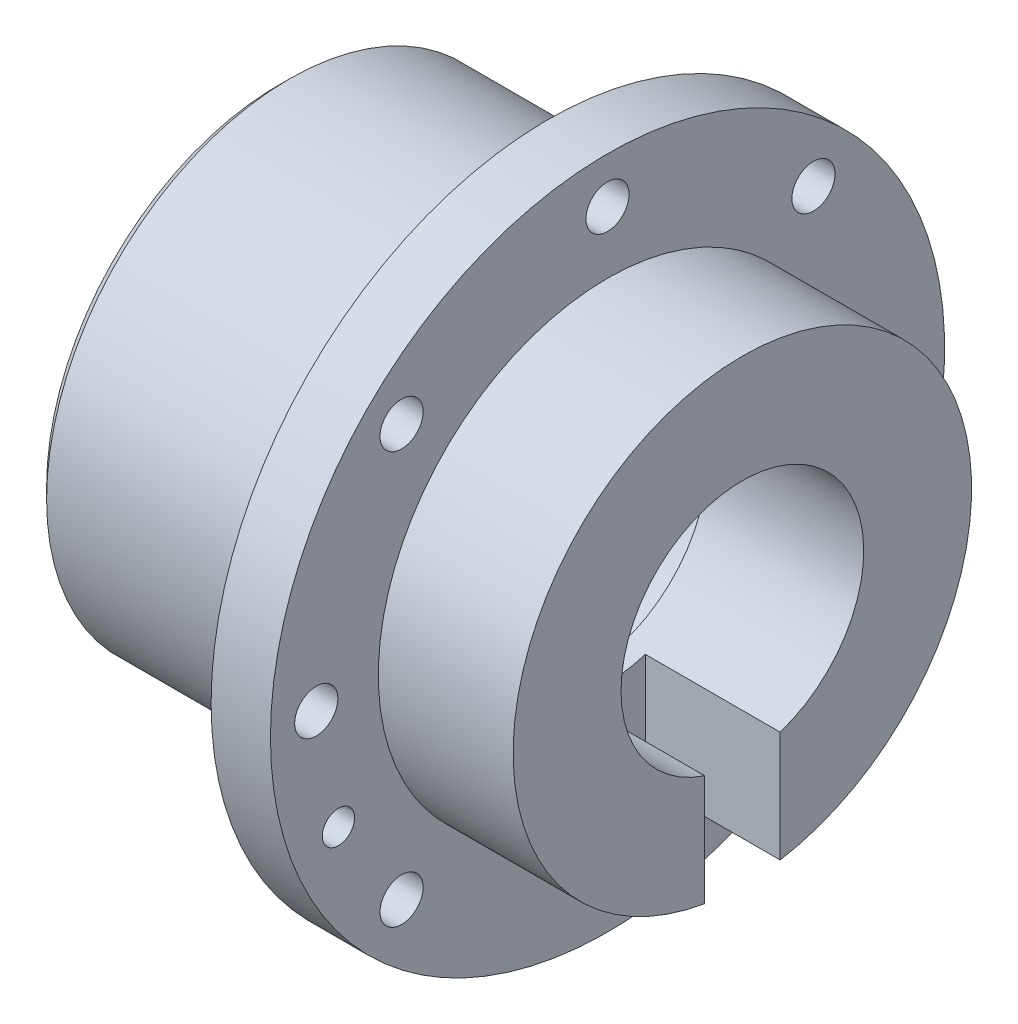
from build123d import *

# Parameters (mm, degrees)
ESQUISSE2_W                  = 14
ESQUISSE2_H                  = 41.556865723
ENL_V_MAT_EXTRU_1_DEPTH      = 25
TROU_TARAUD_M101_D           = 8
R_P_TITION_CIRCULAIRE1_COUNT = 8
TROU_TARAUD_M81_D            = 6
R_P_TITION_CIRCULAIRE2_COUNT = 2
R_P_TITION_CIRCULAIRE2_ANGLE = 135


with BuildPart() as part:
    # Esquisse1 → R_volution1 (revolve)
    with BuildSketch(Plane.XY, mode=Mode.PRIVATE) as r_volution1_sk:
        Polygon((0.295254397, 45), (48.295254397, 45), (48.295254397, 62.5), (59.295254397, 62.5), (59.295254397, 42.5), (84.295254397, 42.5), (84.295254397, 22.5), (55.30487334, 22.5), (52.418121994, 27.5), (26.295254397, 27.5), (26.295254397, 32.5), (5.795254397, 32.5), (-1.704745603, 40), (-1.704745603, 43), align=None)
    revolve(r_volution1_sk.sketch.rotate(Axis((0, 0, 0), (1, 0, 0)), 90), axis=Axis((0, 0, 0), (1, 0, 0)))

    # Esquisse2 → Enl_v. mat.-Extru.1 (cut)
    with BuildSketch(Plane(origin=(84.295254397, 0, 0), x_dir=(0, 0, -1), z_dir=(1, 0, 0))):
        with Locations((0, -33.880104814)):
            Rectangle(ESQUISSE2_W, ESQUISSE2_H)
    extrude(amount=-ENL_V_MAT_EXTRU_1_DEPTH, mode=Mode.SUBTRACT)

    # Trou taraud_ M101 (through all)
    with Locations(Plane(origin=(59.295254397, 0, 0), x_dir=(0, 0, -1), z_dir=(1, 0, 0))):
        with Locations((0, 54)):
            trou_taraud_m101 = Hole(TROU_TARAUD_M101_D / 2)

    # R_p_tition circulaire1: Trou taraud_ M101 ×8 about axis, 1 skipped
    r_p_tition_circulaire1_axis = Axis((0, 0, 0), (1, 0, 0))
    add([trou_taraud_m101.rotate(r_p_tition_circulaire1_axis, i * 360 / R_P_TITION_CIRCULAIRE1_COUNT) for i in range(1, R_P_TITION_CIRCULAIRE1_COUNT) if i not in (4,)], mode=Mode.SUBTRACT)

    # Trou taraud_ M81 (through all)
    with Locations(Plane(origin=(59.295254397, 0, 0), x_dir=(0, 0, -1), z_dir=(1, 0, 0))):
        with Locations((-49.889494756, -20.664905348)):
            trou_taraud_m81 = Hole(TROU_TARAUD_M81_D / 2)

    # R_p_tition circulaire2: Trou taraud_ M81 ×2 about axis
    r_p_tition_circulaire2_axis = Axis((0, 0, 0), (1, 0, 0))
    for i in range(1, R_P_TITION_CIRCULAIRE2_COUNT):
        add(trou_taraud_m81.rotate(r_p_tition_circulaire2_axis, i * R_P_TITION_CIRCULAIRE2_ANGLE / (R_P_TITION_CIRCULAIRE2_COUNT - 1)), mode=Mode.SUBTRACT)


solid = part.part
